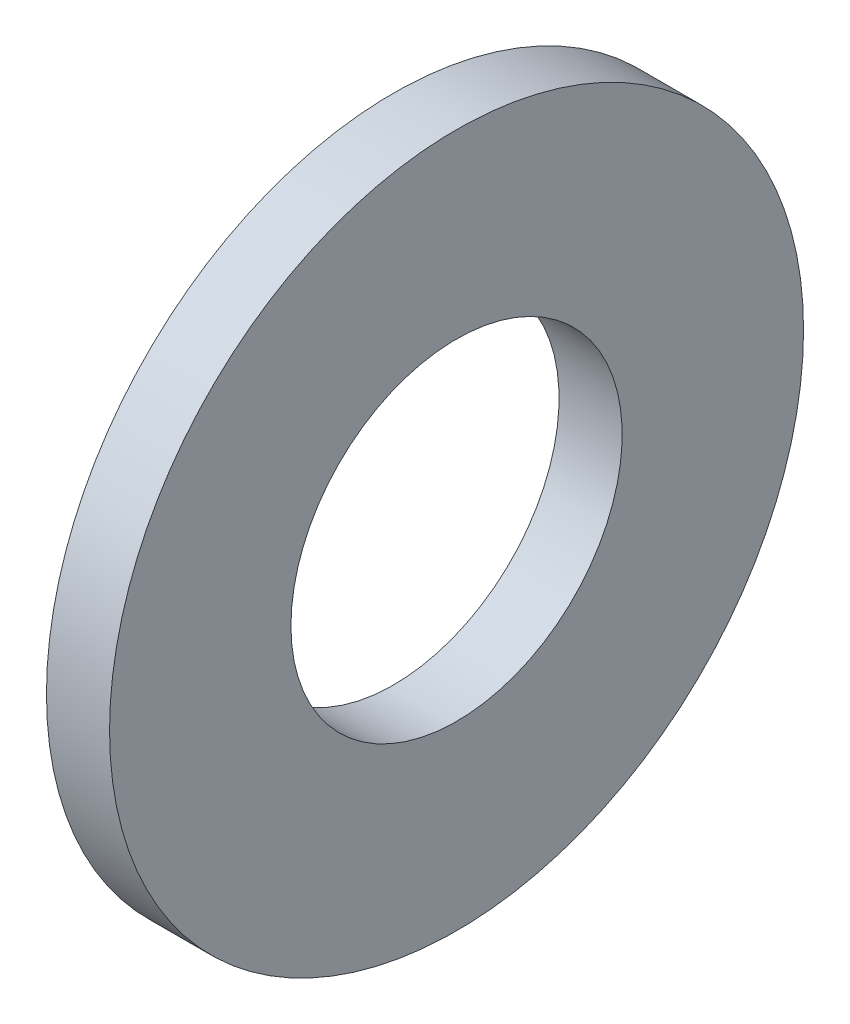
from build123d import *

# Parameters (mm, degrees)
ESQUISSE1_W = 2
ESQUISSE1_H = 5.75


with BuildPart() as part:
    # Esquisse1 → Base-R_volution (revolve)
    with BuildSketch(Plane(origin=(0, 0, 0), x_dir=(1, 0, 0), z_dir=(0, 1, 0)), mode=Mode.PRIVATE) as base_r_volution_sk:
        with Locations((1, 8.125)):
            Rectangle(ESQUISSE1_W, ESQUISSE1_H)
    revolve(base_r_volution_sk.sketch.rotate(Axis((0, 0, 0), (1, 0, 0)), 180), axis=Axis((0, 0, 0), (1, 0, 0)))


solid = part.part
